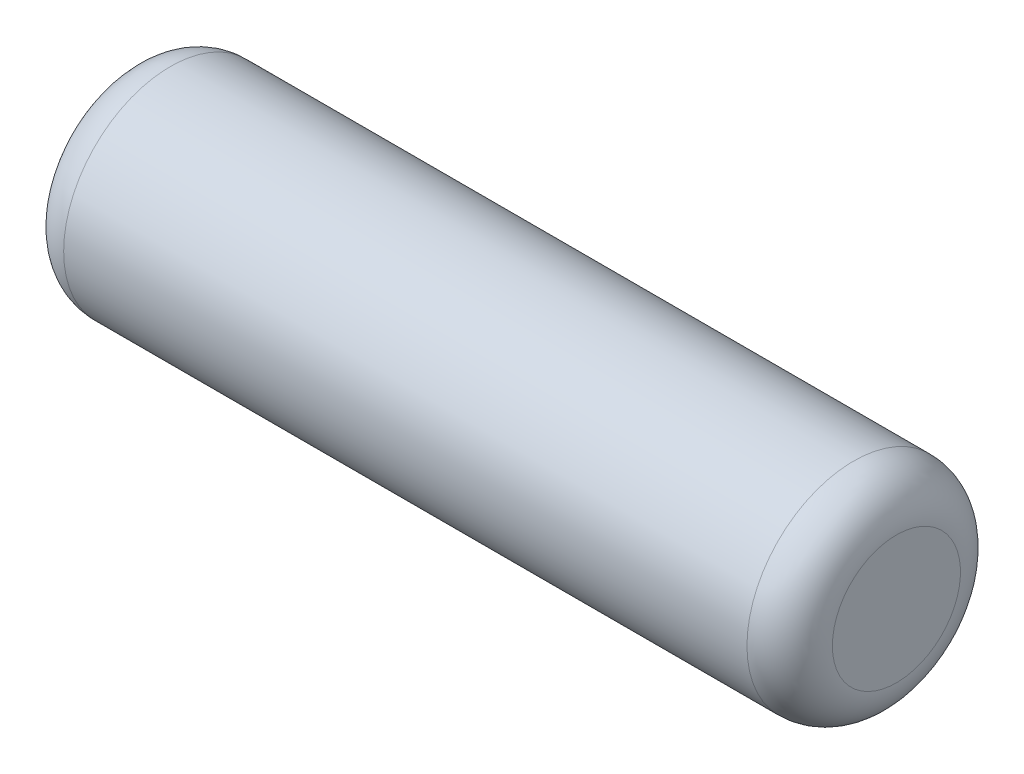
ISO-10303-21;
HEADER;
FILE_DESCRIPTION(('STEP AP214'),'2;1');
FILE_NAME('part.step','',(''),(''),'','','');
FILE_SCHEMA(('AUTOMOTIVE_DESIGN { 1 0 10303 214 1 1 1 1 }'));
ENDSEC;
DATA;
#1=APPLICATION_CONTEXT('core data for automotive mechanical design processes');
#2=APPLICATION_PROTOCOL_DEFINITION('international standard','automotive_design',2000,#1);
#3=PRODUCT_CONTEXT('',#1,'mechanical');
#4=PRODUCT('Part','Part','',(#3));
#5=PRODUCT_RELATED_PRODUCT_CATEGORY('part','',(#4));
#6=PRODUCT_DEFINITION_FORMATION('','',#4);
#7=PRODUCT_DEFINITION_CONTEXT('part definition',#1,'design');
#8=PRODUCT_DEFINITION('design','',#6,#7);
#9=PRODUCT_DEFINITION_SHAPE('','',#8);
#10=(LENGTH_UNIT() NAMED_UNIT(*) SI_UNIT(.MILLI.,.METRE.));
#11=(NAMED_UNIT(*) PLANE_ANGLE_UNIT() SI_UNIT($,.RADIAN.));
#12=(NAMED_UNIT(*) SI_UNIT($,.STERADIAN.) SOLID_ANGLE_UNIT());
#13=UNCERTAINTY_MEASURE_WITH_UNIT(LENGTH_MEASURE(1.E-05),#10,'distance_accuracy_value','');
#14=(GEOMETRIC_REPRESENTATION_CONTEXT(3) GLOBAL_UNCERTAINTY_ASSIGNED_CONTEXT((#13)) GLOBAL_UNIT_ASSIGNED_CONTEXT((#10,
#11,#12)) REPRESENTATION_CONTEXT('',''));
#15=CARTESIAN_POINT('',(0.,0.,0.));
#16=DIRECTION('',(0.,0.,1.));
#17=DIRECTION('',(1.,0.,0.));
#18=AXIS2_PLACEMENT_3D('',#15,#16,#17);
#19=CARTESIAN_POINT('',(0.,0.,0.));
#20=DIRECTION('',(1.,0.,0.));
#21=DIRECTION('',(0.,0.,-1.));
#22=AXIS2_PLACEMENT_3D('',#19,#20,#21);
#23=PLANE('',#22);
#24=CARTESIAN_POINT('',(0.,0.,0.));
#25=DIRECTION('',(1.,0.,0.));
#26=DIRECTION('',(0.,0.,-1.));
#27=AXIS2_PLACEMENT_3D('',#24,#25,#26);
#28=CIRCLE('',#27,3.);
#29=CARTESIAN_POINT('',(0.,0.,-3.));
#30=VERTEX_POINT('',#29);
#31=EDGE_CURVE('E29',#30,#30,#28,.F.);
#32=ORIENTED_EDGE('',*,*,#31,.T.);
#33=EDGE_LOOP('',(#32));
#34=FACE_BOUND('',#33,.T.);
#35=ADVANCED_FACE('F14',(#34),#23,.F.);
#36=CARTESIAN_POINT('',(0.,0.,0.));
#37=DIRECTION('',(-1.,0.,0.));
#38=DIRECTION('',(0.,0.,1.));
#39=AXIS2_PLACEMENT_3D('',#36,#37,#38);
#40=CYLINDRICAL_SURFACE('',#39,5.);
#41=CARTESIAN_POINT('',(2.,0.,0.));
#42=DIRECTION('',(1.,0.,0.));
#43=DIRECTION('',(0.,0.,-1.));
#44=AXIS2_PLACEMENT_3D('',#41,#42,#43);
#45=CIRCLE('',#44,5.);
#46=CARTESIAN_POINT('',(2.,0.,-5.));
#47=VERTEX_POINT('',#46);
#48=EDGE_CURVE('E21',#47,#47,#45,.T.);
#49=ORIENTED_EDGE('',*,*,#48,.T.);
#50=EDGE_LOOP('',(#49));
#51=FACE_BOUND('',#50,.T.);
#52=CARTESIAN_POINT('',(34.,0.,0.));
#53=DIRECTION('',(-1.,0.,0.));
#54=DIRECTION('',(0.,0.,1.));
#55=AXIS2_PLACEMENT_3D('',#52,#53,#54);
#56=CIRCLE('',#55,5.);
#57=CARTESIAN_POINT('',(34.,0.,5.));
#58=VERTEX_POINT('',#57);
#59=EDGE_CURVE('E25',#58,#58,#56,.T.);
#60=ORIENTED_EDGE('',*,*,#59,.T.);
#61=EDGE_LOOP('',(#60));
#62=FACE_BOUND('',#61,.T.);
#63=ADVANCED_FACE('F47',(#51,#62),#40,.T.);
#64=CARTESIAN_POINT('',(36.,5.,0.));
#65=DIRECTION('',(-1.,0.,0.));
#66=DIRECTION('',(0.,0.,1.));
#67=AXIS2_PLACEMENT_3D('',#64,#65,#66);
#68=PLANE('',#67);
#69=CARTESIAN_POINT('',(36.,0.,0.));
#70=DIRECTION('',(-1.,0.,0.));
#71=DIRECTION('',(0.,0.,1.));
#72=AXIS2_PLACEMENT_3D('',#69,#70,#71);
#73=CIRCLE('',#72,3.);
#74=CARTESIAN_POINT('',(36.,0.,3.));
#75=VERTEX_POINT('',#74);
#76=EDGE_CURVE('E9',#75,#75,#73,.F.);
#77=ORIENTED_EDGE('',*,*,#76,.T.);
#78=EDGE_LOOP('',(#77));
#79=FACE_BOUND('',#78,.T.);
#80=ADVANCED_FACE('F38',(#79),#68,.F.);
#81=CARTESIAN_POINT('',(2.,0.,0.));
#82=DIRECTION('',(1.,0.,0.));
#83=DIRECTION('',(0.,0.,-1.));
#84=AXIS2_PLACEMENT_3D('',#81,#82,#83);
#85=TOROIDAL_SURFACE('',#84,3.,2.);
#86=ORIENTED_EDGE('',*,*,#48,.F.);
#87=EDGE_LOOP('',(#86));
#88=FACE_BOUND('',#87,.T.);
#89=ORIENTED_EDGE('',*,*,#31,.F.);
#90=EDGE_LOOP('',(#89));
#91=FACE_BOUND('',#90,.T.);
#92=ADVANCED_FACE('F36',(#88,#91),#85,.T.);
#93=CARTESIAN_POINT('',(34.,0.,0.));
#94=DIRECTION('',(-1.,0.,0.));
#95=DIRECTION('',(0.,0.,1.));
#96=AXIS2_PLACEMENT_3D('',#93,#94,#95);
#97=TOROIDAL_SURFACE('',#96,3.,2.);
#98=ORIENTED_EDGE('',*,*,#76,.F.);
#99=EDGE_LOOP('',(#98));
#100=FACE_BOUND('',#99,.T.);
#101=ORIENTED_EDGE('',*,*,#59,.F.);
#102=EDGE_LOOP('',(#101));
#103=FACE_BOUND('',#102,.T.);
#104=ADVANCED_FACE('F16',(#100,#103),#97,.T.);
#105=CLOSED_SHELL('',(#35,#63,#80,#92,#104));
#106=MANIFOLD_SOLID_BREP('B1',#105);
#107=ADVANCED_BREP_SHAPE_REPRESENTATION('',(#18,#106),#14);
#108=SHAPE_DEFINITION_REPRESENTATION(#9,#107);
ENDSEC;
END-ISO-10303-21;
